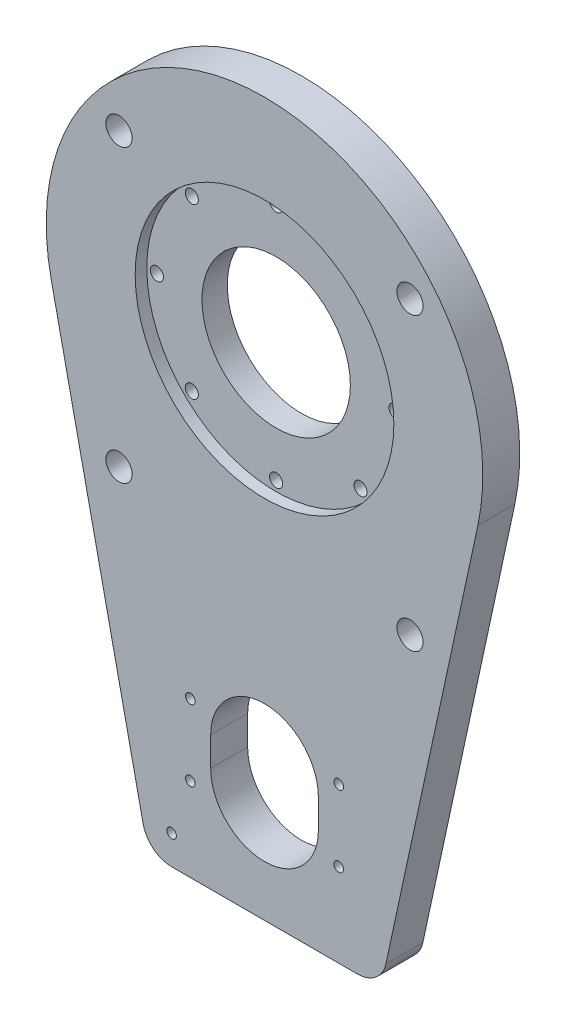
from build123d import *

# Parameters (mm, degrees)
BOSS_EXTRUDE1_DEPTH                                 = 12.7
CUT_EXTRUDE1_DEPTH                                  = 187.242556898
HOLE1_D                                             = 9
F_4_CLEARANCE_HOLE1_D                               = 3.3
HOLE2_D                                             = 51
HOLE2_CBORE_D                                       = 88.9
HOLE2_CBORE_DEPTH                                   = 4
CBORE_FOR_8_BINDING_HEAD_MACHINE_SCREW1_D           = 4.5
CBORE_FOR_8_BINDING_HEAD_MACHINE_SCREW1_DEPTH       = 12.7
CBORE_FOR_8_BINDING_HEAD_MACHINE_SCREW1_CBORE_D     = 8.25
CBORE_FOR_8_BINDING_HEAD_MACHINE_SCREW1_CBORE_DEPTH = 4
FILLET1_R                                           = 10


with BuildPart() as part:
    # Sketch1 → Boss-Extrude1 (new body)
    with BuildSketch(Plane.XY.offset(12.7)):
        with BuildLine():
            Line((40, -170), (73.308387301, -15.839202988))
            ThreePointArc((73.308387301, -15.839202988), (0, 75), (-73.308387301, -15.839202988))
            Line((-73.308387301, -15.839202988), (-40, -170))
            Line((-40, -170), (40, -170))
        make_face()
    extrude(amount=-BOSS_EXTRUDE1_DEPTH)

    # Sketch2 → Cut-Extrude1 (cut, through all)
    with BuildSketch(Plane(origin=(0, 0, 0), x_dir=(-1, 0, 0), z_dir=(0, 0, -1))):
        with BuildLine():
            Line((-18.5, -124), (-18.5, -134))
            ThreePointArc((-18.5, -134), (0, -152.5), (18.5, -134))
            Line((18.5, -134), (18.5, -124))
            ThreePointArc((18.5, -124), (0, -105.5), (-18.5, -124))
        make_face()
    extrude(amount=-CUT_EXTRUDE1_DEPTH, mode=Mode.SUBTRACT)

    # Hole1 (through all)
    with Locations(Plane(origin=(0, 0, 0), x_dir=(-1, 0, 0), z_dir=(0, 0, -1))):
        with Locations((-50, -60), (50, -60), (50, 40), (-50, 40)):
            Hole(HOLE1_D / 2)

    # 4 Clearance Hole1 (through all)
    with Locations(Plane.XY.offset(12.7)):
        with Locations((-31.929873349, -160), (-25.5, -116.75), (-25.5, -141.25), (25.5, -116.75), (25.5, -141.25)):
            Hole(F_4_CLEARANCE_HOLE1_D / 2)

    # Hole2 (through all)
    with Locations(Plane.XY.offset(12.7)):
        with Locations((0, 0)):
            CounterBoreHole(HOLE2_D / 2, HOLE2_CBORE_D / 2, HOLE2_CBORE_DEPTH)

    # CBORE for _8 Binding Head Machine Screw1
    with Locations(Plane(origin=(0, 0, 0), x_dir=(-1, 0, 0), z_dir=(0, 0, -1))):
        with Locations((28.991378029, 28.991378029), (41, 0), (28.991378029, -28.991378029), (0, -41), (-28.991378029, -28.991378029), (-41, 0), (-28.991378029, 28.991378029), (0, 41)):
            CounterBoreHole(CBORE_FOR_8_BINDING_HEAD_MACHINE_SCREW1_D / 2, CBORE_FOR_8_BINDING_HEAD_MACHINE_SCREW1_CBORE_D / 2, CBORE_FOR_8_BINDING_HEAD_MACHINE_SCREW1_CBORE_DEPTH, depth=CBORE_FOR_8_BINDING_HEAD_MACHINE_SCREW1_DEPTH)

    # Fillet1
    fillet1_edges = [part.edges().sort_by_distance(p)[0] for p in [
        (-40, -170, 6.35),
        (40, -170, 6.35),
    ]]
    fillet(fillet1_edges, radius=FILLET1_R)


solid = part.part
